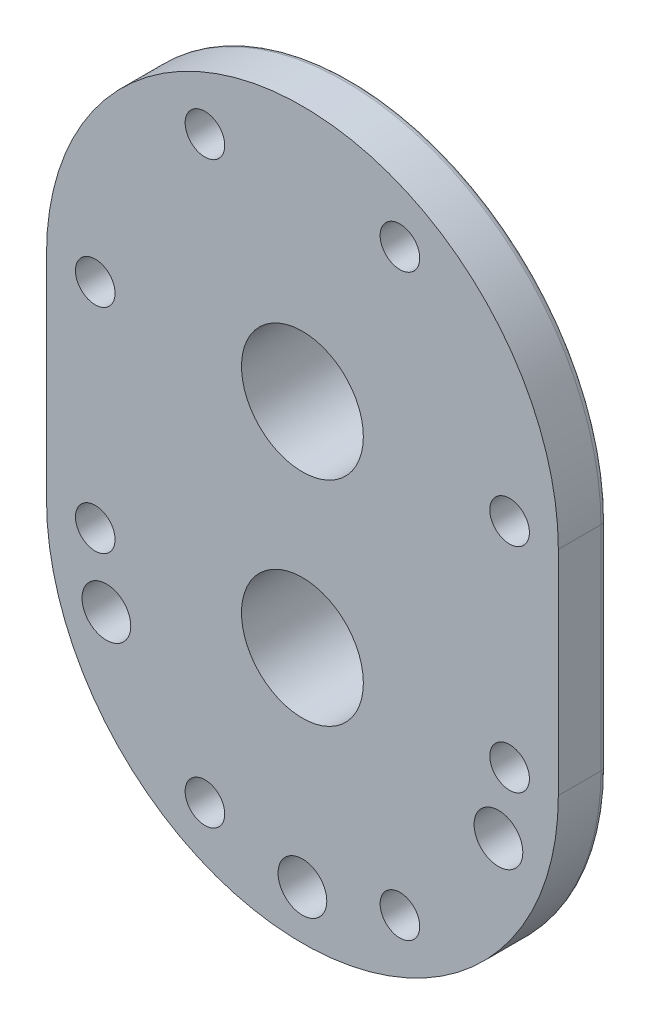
from build123d import *

# Parameters (mm, degrees)
EXTRUDE_1_DEPTH     = 8
EXTRUDE_2_DEPTH     = 24.5
SKETCH_10_R         = 10
CUT_EXTRUDE_1_DEPTH = 19.5
SKETCH_11_R         = 3.25
CUT_EXTRUDE_2_DEPTH = 92.067282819
FILLET_1_R          = 1
SKETCH_12_R         = 4
CUT_EXTRUDE_3_DEPTH = 92.067282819


with BuildPart() as part:
    # Sketch 8 → Extrude 1 (new body)
    with BuildSketch(Plane.XY):
        with BuildLine():
            Line((-42, 0), (-42, -35))
            ThreePointArc((-42, -35), (0, -77), (42, -35))
            Line((42, -35), (42, 0))
            ThreePointArc((42, 0), (0, 42), (-42, 0))
        make_face()
    extrude(amount=-EXTRUDE_1_DEPTH)

    # Sketch 9 → Extrude 2 (add)
    with BuildSketch(Plane.XY):
        with BuildLine():
            Line((-18, 0), (-18, -35))
            ThreePointArc((-18, -35), (0, -53), (18, -35))
            Line((18, -35), (18, 0))
            ThreePointArc((18, 0), (0, 18), (-18, 0))
        make_face()
    extrude(amount=-EXTRUDE_2_DEPTH)

    # Sketch 10 → Cut-Extrude 1 (cut)
    with BuildSketch(Plane.XY):
        Circle(SKETCH_10_R)
        with Locations((0, -35)):
            Circle(SKETCH_10_R)
    extrude(amount=-CUT_EXTRUDE_1_DEPTH, mode=Mode.SUBTRACT)

    # Sketch 11 → Cut-Extrude 2 (cut, through all)
    with BuildSketch(Plane.XY):
        with Locations((-16, 30)):
            Circle(SKETCH_11_R)
    cut_extrude_2 = extrude(amount=-CUT_EXTRUDE_2_DEPTH, mode=Mode.SUBTRACT)

    # Pattern Sketch 1: Cut-Extrude 2 at 7 more places
    with Locations((32, 0, 0), (50, -30, 0), (50, -65, 0), (32, -95, 0), (0, -95, 0), (-18, -65, 0), (-18, -30, 0)):
        add(cut_extrude_2, mode=Mode.SUBTRACT)

    # Fillet 1
    fillet_1_edges = [part.edges().sort_by_distance(p)[0] for p in [
        (0, -77, -8),
        (42, -17.5, -8),
        (0, 18, -24.5),
        (18, -17.5, -24.5),
        (0, -53, -24.5),
        (-18, -17.5, -24.5),
        (0, 18, -8),
        (18, -17.5, -8),
        (0, -53, -8),
        (-18, -17.5, -8),
        (0, 42, -8),
        (-42, -17.5, -8),
    ]]
    fillet(fillet_1_edges, radius=FILLET_1_R)

    # Sketch 12 → Cut-Extrude 3 (cut, through all)
    with BuildSketch(Plane.XY):
        with Locations((-32.171415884, -46)):
            Circle(SKETCH_12_R)
        with Locations((0, -69)):
            Circle(SKETCH_12_R)
        with Locations((32.171415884, -46)):
            Circle(SKETCH_12_R)
    extrude(amount=-CUT_EXTRUDE_3_DEPTH, mode=Mode.SUBTRACT)


solid = part.part
